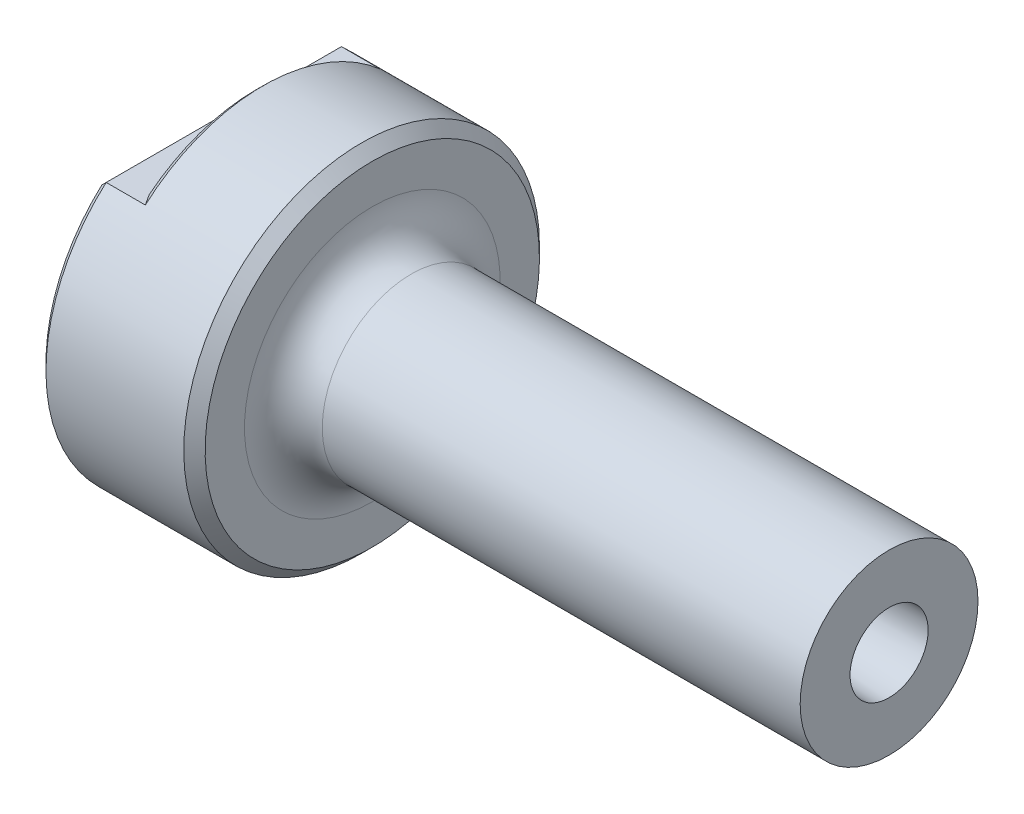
ISO-10303-21;
HEADER;
FILE_DESCRIPTION(('STEP AP214'),'2;1');
FILE_NAME('part.step','',(''),(''),'','','');
FILE_SCHEMA(('AUTOMOTIVE_DESIGN { 1 0 10303 214 1 1 1 1 }'));
ENDSEC;
DATA;
#1=APPLICATION_CONTEXT('core data for automotive mechanical design processes');
#2=APPLICATION_PROTOCOL_DEFINITION('international standard','automotive_design',2000,#1);
#3=PRODUCT_CONTEXT('',#1,'mechanical');
#4=PRODUCT('Part','Part','',(#3));
#5=PRODUCT_RELATED_PRODUCT_CATEGORY('part','',(#4));
#6=PRODUCT_DEFINITION_FORMATION('','',#4);
#7=PRODUCT_DEFINITION_CONTEXT('part definition',#1,'design');
#8=PRODUCT_DEFINITION('design','',#6,#7);
#9=PRODUCT_DEFINITION_SHAPE('','',#8);
#10=(LENGTH_UNIT() NAMED_UNIT(*) SI_UNIT(.MILLI.,.METRE.));
#11=(NAMED_UNIT(*) PLANE_ANGLE_UNIT() SI_UNIT($,.RADIAN.));
#12=(NAMED_UNIT(*) SI_UNIT($,.STERADIAN.) SOLID_ANGLE_UNIT());
#13=UNCERTAINTY_MEASURE_WITH_UNIT(LENGTH_MEASURE(1.E-05),#10,'distance_accuracy_value','');
#14=(GEOMETRIC_REPRESENTATION_CONTEXT(3) GLOBAL_UNCERTAINTY_ASSIGNED_CONTEXT((#13)) GLOBAL_UNIT_ASSIGNED_CONTEXT((#10,
#11,#12)) REPRESENTATION_CONTEXT('',''));
#15=CARTESIAN_POINT('',(0.,0.,0.));
#16=DIRECTION('',(0.,0.,1.));
#17=DIRECTION('',(1.,0.,0.));
#18=AXIS2_PLACEMENT_3D('',#15,#16,#17);
#19=CARTESIAN_POINT('',(48.021875,0.,0.));
#20=DIRECTION('',(1.,0.,0.));
#21=DIRECTION('',(0.,0.,-1.));
#22=AXIS2_PLACEMENT_3D('',#19,#20,#21);
#23=PLANE('',#22);
#24=CARTESIAN_POINT('',(48.021875,0.,0.));
#25=DIRECTION('',(1.,0.,0.));
#26=DIRECTION('',(0.,1.,0.));
#27=AXIS2_PLACEMENT_3D('',#24,#25,#26);
#28=CIRCLE('',#27,12.7);
#29=CARTESIAN_POINT('',(48.021875,12.7,0.));
#30=VERTEX_POINT('',#29);
#31=EDGE_CURVE('E102',#30,#30,#28,.T.);
#32=ORIENTED_EDGE('',*,*,#31,.T.);
#33=EDGE_LOOP('',(#32));
#34=FACE_BOUND('',#33,.T.);
#35=CARTESIAN_POINT('',(48.021875,0.,0.));
#36=DIRECTION('',(1.,0.,0.));
#37=DIRECTION('',(0.,1.,0.));
#38=AXIS2_PLACEMENT_3D('',#35,#36,#37);
#39=CIRCLE('',#38,5.57787310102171);
#40=CARTESIAN_POINT('',(48.021875,5.57787310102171,0.));
#41=VERTEX_POINT('',#40);
#42=EDGE_CURVE('E158',#41,#41,#39,.T.);
#43=ORIENTED_EDGE('',*,*,#42,.F.);
#44=EDGE_LOOP('',(#43));
#45=FACE_BOUND('',#44,.T.);
#46=ADVANCED_FACE('F33',(#34,#45),#23,.T.);
#47=CARTESIAN_POINT('',(-48.021875,0.,0.));
#48=DIRECTION('',(1.,0.,0.));
#49=DIRECTION('',(0.,0.,-1.));
#50=AXIS2_PLACEMENT_3D('',#47,#48,#49);
#51=PLANE('',#50);
#52=CARTESIAN_POINT('',(-48.021875,0.,0.));
#53=DIRECTION('',(1.,0.,0.));
#54=DIRECTION('',(0.,0.,-1.));
#55=AXIS2_PLACEMENT_3D('',#52,#53,#54);
#56=CIRCLE('',#55,24.384);
#57=CARTESIAN_POINT('',(-48.021875,18.034,-16.4120169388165));
#58=VERTEX_POINT('',#57);
#59=CARTESIAN_POINT('',(-48.021875,18.034,16.4120169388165));
#60=VERTEX_POINT('',#59);
#61=EDGE_CURVE('E53',#58,#60,#56,.F.);
#62=ORIENTED_EDGE('',*,*,#61,.T.);
#63=DIRECTION('',(0.,0.,-1.));
#64=VECTOR('',#63,1.);
#65=CARTESIAN_POINT('',(-48.021875,18.034,0.));
#66=LINE('',#65,#64);
#67=EDGE_CURVE('E127',#60,#58,#66,.T.);
#68=ORIENTED_EDGE('',*,*,#67,.T.);
#69=EDGE_LOOP('',(#62,#68));
#70=FACE_BOUND('',#69,.T.);
#71=CARTESIAN_POINT('',(-48.021875,0.,0.));
#72=DIRECTION('',(1.,0.,0.));
#73=DIRECTION('',(0.,1.,0.));
#74=AXIS2_PLACEMENT_3D('',#71,#72,#73);
#75=CIRCLE('',#74,9.80045101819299);
#76=CARTESIAN_POINT('',(-48.021875,9.80045101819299,0.));
#77=VERTEX_POINT('',#76);
#78=EDGE_CURVE('E107',#77,#77,#75,.T.);
#79=ORIENTED_EDGE('',*,*,#78,.T.);
#80=EDGE_LOOP('',(#79));
#81=FACE_BOUND('',#80,.T.);
#82=ADVANCED_FACE('F167',(#70,#81),#51,.F.);
#83=CARTESIAN_POINT('',(48.021875,0.,0.));
#84=DIRECTION('',(-1.,0.,0.));
#85=DIRECTION('',(0.,0.,1.));
#86=AXIS2_PLACEMENT_3D('',#83,#84,#85);
#87=CYLINDRICAL_SURFACE('',#86,25.4);
#88=CARTESIAN_POINT('',(-27.320875,0.,0.));
#89=DIRECTION('',(1.,0.,0.));
#90=DIRECTION('',(0.,0.,-1.));
#91=AXIS2_PLACEMENT_3D('',#88,#89,#90);
#92=CIRCLE('',#91,25.4);
#93=CARTESIAN_POINT('',(-27.320875,0.,-25.4));
#94=VERTEX_POINT('',#93);
#95=EDGE_CURVE('E98',#94,#94,#92,.F.);
#96=ORIENTED_EDGE('',*,*,#95,.T.);
#97=EDGE_LOOP('',(#96));
#98=FACE_BOUND('',#97,.T.);
#99=DIRECTION('',(-1.,0.,0.));
#100=VECTOR('',#99,1.);
#101=CARTESIAN_POINT('',(48.021875,19.05,-16.8005208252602));
#102=LINE('',#101,#100);
#103=CARTESIAN_POINT('',(-47.005875,19.05,-16.8005208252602));
#104=VERTEX_POINT('',#103);
#105=CARTESIAN_POINT('',(-41.417875,19.05,-16.8005208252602));
#106=VERTEX_POINT('',#105);
#107=EDGE_CURVE('E101',#104,#106,#102,.F.);
#108=ORIENTED_EDGE('',*,*,#107,.T.);
#109=CARTESIAN_POINT('',(-41.417875,0.,0.));
#110=DIRECTION('',(-1.,0.,0.));
#111=DIRECTION('',(0.,0.,1.));
#112=AXIS2_PLACEMENT_3D('',#109,#110,#111);
#113=CIRCLE('',#112,25.4);
#114=CARTESIAN_POINT('',(-41.417875,19.05,16.8005208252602));
#115=VERTEX_POINT('',#114);
#116=EDGE_CURVE('E87',#106,#115,#113,.F.);
#117=ORIENTED_EDGE('',*,*,#116,.T.);
#118=DIRECTION('',(-1.,0.,0.));
#119=VECTOR('',#118,1.);
#120=CARTESIAN_POINT('',(48.021875,19.05,16.8005208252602));
#121=LINE('',#120,#119);
#122=CARTESIAN_POINT('',(-47.005875,19.05,16.8005208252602));
#123=VERTEX_POINT('',#122);
#124=EDGE_CURVE('E104',#115,#123,#121,.T.);
#125=ORIENTED_EDGE('',*,*,#124,.T.);
#126=CARTESIAN_POINT('',(-47.005875,0.,0.));
#127=DIRECTION('',(1.,0.,0.));
#128=DIRECTION('',(0.,0.,-1.));
#129=AXIS2_PLACEMENT_3D('',#126,#127,#128);
#130=CIRCLE('',#129,25.4);
#131=EDGE_CURVE('E97',#123,#104,#130,.T.);
#132=ORIENTED_EDGE('',*,*,#131,.T.);
#133=EDGE_LOOP('',(#108,#117,#125,#132));
#134=FACE_BOUND('',#133,.T.);
#135=ADVANCED_FACE('F189',(#98,#134),#87,.T.);
#136=CARTESIAN_POINT('',(-42.433875,0.,0.));
#137=DIRECTION('',(-1.,0.,0.));
#138=DIRECTION('',(0.,0.,1.));
#139=AXIS2_PLACEMENT_3D('',#136,#137,#138);
#140=PLANE('',#139);
#141=DIRECTION('',(0.,0.,1.));
#142=VECTOR('',#141,1.);
#143=CARTESIAN_POINT('',(-42.433875,19.05,-25.4));
#144=LINE('',#143,#142);
#145=CARTESIAN_POINT('',(-42.433875,19.05,-15.2209380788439));
#146=VERTEX_POINT('',#145);
#147=CARTESIAN_POINT('',(-42.433875,19.05,15.2209380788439));
#148=VERTEX_POINT('',#147);
#149=EDGE_CURVE('E96',#146,#148,#144,.T.);
#150=ORIENTED_EDGE('',*,*,#149,.T.);
#151=CARTESIAN_POINT('',(-42.433875,0.,0.));
#152=DIRECTION('',(-1.,0.,0.));
#153=DIRECTION('',(0.,0.,1.));
#154=AXIS2_PLACEMENT_3D('',#151,#152,#153);
#155=CIRCLE('',#154,24.384);
#156=EDGE_CURVE('E85',#148,#146,#155,.T.);
#157=ORIENTED_EDGE('',*,*,#156,.T.);
#158=EDGE_LOOP('',(#150,#157));
#159=FACE_BOUND('',#158,.T.);
#160=ADVANCED_FACE('F95',(#159),#140,.T.);
#161=CARTESIAN_POINT('',(-42.433875,19.05,-25.4));
#162=DIRECTION('',(0.,-1.,0.));
#163=DIRECTION('',(0.,0.,-1.));
#164=AXIS2_PLACEMENT_3D('',#161,#162,#163);
#165=PLANE('',#164);
#166=ORIENTED_EDGE('',*,*,#107,.F.);
#167=DIRECTION('',(0.,0.,1.));
#168=VECTOR('',#167,1.);
#169=CARTESIAN_POINT('',(-47.005875,19.05,-25.4));
#170=LINE('',#169,#168);
#171=EDGE_CURVE('E91',#104,#123,#170,.T.);
#172=ORIENTED_EDGE('',*,*,#171,.T.);
#173=ORIENTED_EDGE('',*,*,#124,.F.);
#174=CARTESIAN_POINT('',(-41.417875,19.05,16.8005208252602));
#175=CARTESIAN_POINT('',(-41.5042219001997,19.05,16.6699759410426));
#176=CARTESIAN_POINT('',(-41.590175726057,19.05,16.5391707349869));
#177=CARTESIAN_POINT('',(-41.7612541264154,19.05,16.2770272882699));
#178=CARTESIAN_POINT('',(-41.8463787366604,19.05,16.1456890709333));
#179=CARTESIAN_POINT('',(-42.0157633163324,19.05,15.8824555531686));
#180=CARTESIAN_POINT('',(-42.1000232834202,19.05,15.7505602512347));
#181=CARTESIAN_POINT('',(-42.2676390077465,19.05,15.4861884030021));
#182=CARTESIAN_POINT('',(-42.3509947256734,19.05,15.3537118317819));
#183=CARTESIAN_POINT('',(-42.433875,19.05,15.2209380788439));
#184=B_SPLINE_CURVE_WITH_KNOTS('',3,(#174,#175,#176,#177,#178,#179,#180,#181,#182,#183),
.UNSPECIFIED.,.F.,.F.,(4,2,2,2,4),(0.,0.4695524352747,0.939084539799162,1.40861791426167,
1.87817162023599),.UNSPECIFIED.);
#185=EDGE_CURVE('E11',#115,#148,#184,.T.);
#186=ORIENTED_EDGE('',*,*,#185,.T.);
#187=ORIENTED_EDGE('',*,*,#149,.F.);
#188=CARTESIAN_POINT('',(-42.433875,19.05,-15.2209380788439));
#189=CARTESIAN_POINT('',(-42.3509947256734,19.05,-15.3537118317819));
#190=CARTESIAN_POINT('',(-42.2676390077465,19.05,-15.4861884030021));
#191=CARTESIAN_POINT('',(-42.1000232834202,19.05,-15.7505602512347));
#192=CARTESIAN_POINT('',(-42.0157633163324,19.05,-15.8824555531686));
#193=CARTESIAN_POINT('',(-41.8463787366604,19.05,-16.1456890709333));
#194=CARTESIAN_POINT('',(-41.7612541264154,19.05,-16.2770272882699));
#195=CARTESIAN_POINT('',(-41.590175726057,19.05,-16.5391707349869));
#196=CARTESIAN_POINT('',(-41.5042219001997,19.05,-16.6699759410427));
#197=CARTESIAN_POINT('',(-41.417875,19.05,-16.8005208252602));
#198=B_SPLINE_CURVE_WITH_KNOTS('',3,(#188,#189,#190,#191,#192,#193,#194,#195,#196,#197),
.UNSPECIFIED.,.F.,.F.,(4,2,2,2,4),(0.,0.469553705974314,0.939087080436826,1.40861918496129,
1.87817162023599),.UNSPECIFIED.);
#199=EDGE_CURVE('E46',#146,#106,#198,.T.);
#200=ORIENTED_EDGE('',*,*,#199,.T.);
#201=EDGE_LOOP('',(#166,#172,#173,#186,#187,#200));
#202=FACE_BOUND('',#201,.T.);
#203=ADVANCED_FACE('F100',(#202),#165,.F.);
#204=CARTESIAN_POINT('',(-25.796875,-25.4,0.));
#205=DIRECTION('',(1.,0.,0.));
#206=DIRECTION('',(0.,1.,0.));
#207=AXIS2_PLACEMENT_3D('',#204,#205,#206);
#208=PLANE('',#207);
#209=CARTESIAN_POINT('',(-25.796875,0.,0.));
#210=DIRECTION('',(1.,0.,0.));
#211=DIRECTION('',(0.,1.,0.));
#212=AXIS2_PLACEMENT_3D('',#209,#210,#211);
#213=CIRCLE('',#212,23.876);
#214=CARTESIAN_POINT('',(-25.796875,23.876,0.));
#215=VERTEX_POINT('',#214);
#216=EDGE_CURVE('E119',#215,#215,#213,.T.);
#217=ORIENTED_EDGE('',*,*,#216,.T.);
#218=EDGE_LOOP('',(#217));
#219=FACE_BOUND('',#218,.T.);
#220=CARTESIAN_POINT('',(-25.796875,0.,0.));
#221=DIRECTION('',(1.,0.,0.));
#222=DIRECTION('',(0.,1.,0.));
#223=AXIS2_PLACEMENT_3D('',#220,#221,#222);
#224=CIRCLE('',#223,18.25625);
#225=CARTESIAN_POINT('',(-25.796875,18.25625,0.));
#226=VERTEX_POINT('',#225);
#227=EDGE_CURVE('E116',#226,#226,#224,.F.);
#228=ORIENTED_EDGE('',*,*,#227,.T.);
#229=EDGE_LOOP('',(#228));
#230=FACE_BOUND('',#229,.T.);
#231=ADVANCED_FACE('F181',(#219,#230),#208,.T.);
#232=CARTESIAN_POINT('',(48.021875,0.,0.));
#233=DIRECTION('',(1.,0.,0.));
#234=DIRECTION('',(0.,1.,0.));
#235=AXIS2_PLACEMENT_3D('',#232,#233,#234);
#236=CYLINDRICAL_SURFACE('',#235,12.7);
#237=CARTESIAN_POINT('',(-20.240625,0.,0.));
#238=DIRECTION('',(1.,0.,0.));
#239=DIRECTION('',(0.,1.,0.));
#240=AXIS2_PLACEMENT_3D('',#237,#238,#239);
#241=CIRCLE('',#240,12.7);
#242=CARTESIAN_POINT('',(-20.240625,12.7,0.));
#243=VERTEX_POINT('',#242);
#244=EDGE_CURVE('E113',#243,#243,#241,.T.);
#245=ORIENTED_EDGE('',*,*,#244,.T.);
#246=EDGE_LOOP('',(#245));
#247=FACE_BOUND('',#246,.T.);
#248=ORIENTED_EDGE('',*,*,#31,.F.);
#249=EDGE_LOOP('',(#248));
#250=FACE_BOUND('',#249,.T.);
#251=ADVANCED_FACE('F172',(#247,#250),#236,.T.);
#252=CARTESIAN_POINT('',(-56.099075,0.,0.));
#253=DIRECTION('',(1.,0.,0.));
#254=DIRECTION('',(0.,1.,0.));
#255=AXIS2_PLACEMENT_3D('',#252,#253,#254);
#256=SPHERICAL_SURFACE('',#255,12.7);
#257=CARTESIAN_POINT('',(-43.9117164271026,0.,0.));
#258=DIRECTION('',(1.,0.,0.));
#259=DIRECTION('',(0.,1.,0.));
#260=AXIS2_PLACEMENT_3D('',#257,#258,#259);
#261=CIRCLE('',#260,3.571875);
#262=CARTESIAN_POINT('',(-43.9117164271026,3.57187500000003,0.));
#263=VERTEX_POINT('',#262);
#264=EDGE_CURVE('E155',#263,#263,#261,.T.);
#265=CARTESIAN_POINT('',(-43.9117164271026,3.57187500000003,0.));
#266=CARTESIAN_POINT('',(-43.9339064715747,3.64758850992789,0.));
#267=CARTESIAN_POINT('',(-43.9568022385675,3.72309518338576,0.));
#268=CARTESIAN_POINT('',(-44.0039968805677,3.87366875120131,0.));
#269=CARTESIAN_POINT('',(-44.028295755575,3.948735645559,0.));
#270=CARTESIAN_POINT('',(-44.0782882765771,4.09840354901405,0.));
#271=CARTESIAN_POINT('',(-44.1039819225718,4.1730045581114,0.));
#272=CARTESIAN_POINT('',(-44.156755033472,4.32171478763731,0.));
#273=CARTESIAN_POINT('',(-44.1838344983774,4.39582400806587,0.));
#274=CARTESIAN_POINT('',(-44.2393698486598,4.54352491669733,0.));
#275=CARTESIAN_POINT('',(-44.2678257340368,4.61711660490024,0.));
#276=CARTESIAN_POINT('',(-44.3261040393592,4.76375688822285,0.));
#277=CARTESIAN_POINT('',(-44.3559264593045,4.83680548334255,0.));
#278=CARTESIAN_POINT('',(-44.4169274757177,4.98233420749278,0.));
#279=CARTESIAN_POINT('',(-44.4481060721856,5.0548143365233,0.));
#280=CARTESIAN_POINT('',(-44.5118086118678,5.19918095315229,0.));
#281=CARTESIAN_POINT('',(-44.5443325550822,5.27106744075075,0.));
#282=CARTESIAN_POINT('',(-44.6107144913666,5.41422180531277,0.));
#283=CARTESIAN_POINT('',(-44.6445724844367,5.48548968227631,0.));
#284=CARTESIAN_POINT('',(-44.7136107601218,5.62738207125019,0.));
#285=CARTESIAN_POINT('',(-44.7487910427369,5.69800658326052,0.));
#286=CARTESIAN_POINT('',(-44.8204616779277,5.83858771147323,0.));
#287=CARTESIAN_POINT('',(-44.8569520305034,5.9085443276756,0.));
#288=CARTESIAN_POINT('',(-44.9312301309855,6.04776536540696,0.));
#289=CARTESIAN_POINT('',(-44.969017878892,6.11702978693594,0.));
#290=CARTESIAN_POINT('',(-45.0458776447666,6.25484237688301,0.));
#291=CARTESIAN_POINT('',(-45.0849496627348,6.3233905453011,0.));
#292=CARTESIAN_POINT('',(-45.1643643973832,6.4597468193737,0.));
#293=CARTESIAN_POINT('',(-45.2047071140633,6.52755492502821,0.));
#294=CARTESIAN_POINT('',(-45.2866492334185,6.66240752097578,0.));
#295=CARTESIAN_POINT('',(-45.3282486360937,6.72945201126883,0.));
#296=CARTESIAN_POINT('',(-45.4126896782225,6.86275408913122,0.));
#297=CARTESIAN_POINT('',(-45.4555313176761,6.92901167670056,0.));
#298=CARTESIAN_POINT('',(-45.5424419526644,7.06071693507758,0.));
#299=CARTESIAN_POINT('',(-45.586510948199,7.12616460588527,0.));
#300=CARTESIAN_POINT('',(-45.6758609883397,7.25622729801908,0.));
#301=CARTESIAN_POINT('',(-45.7211420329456,7.32084231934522,0.));
#302=CARTESIAN_POINT('',(-45.8129004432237,7.4492172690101,0.));
#303=CARTESIAN_POINT('',(-45.8593778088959,7.51297719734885,0.));
#304=CARTESIAN_POINT('',(-45.9535127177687,7.63961981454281,0.));
#305=CARTESIAN_POINT('',(-46.0011702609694,7.70250250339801,0.));
#306=CARTESIAN_POINT('',(-46.0976489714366,7.82736879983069,0.));
#307=CARTESIAN_POINT('',(-46.1464701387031,7.88935240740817,0.));
#308=CARTESIAN_POINT('',(-46.2452591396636,8.01239901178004,0.));
#309=CARTESIAN_POINT('',(-46.2952269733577,8.07346200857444,0.));
#310=CARTESIAN_POINT('',(-46.3962919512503,8.19464618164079,0.));
#311=CARTESIAN_POINT('',(-46.4473890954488,8.25476735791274,0.));
#312=CARTESIAN_POINT('',(-46.5506949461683,8.37404700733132,0.));
#313=CARTESIAN_POINT('',(-46.6029036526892,8.43320548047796,0.));
#314=CARTESIAN_POINT('',(-46.7084144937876,8.5505391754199,0.));
#315=CARTESIAN_POINT('',(-46.7617166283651,8.60871439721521,0.));
#316=CARTESIAN_POINT('',(-46.869395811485,8.72406138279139,0.));
#317=CARTESIAN_POINT('',(-46.9237728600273,8.78123314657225,0.));
#318=CARTESIAN_POINT('',(-47.0335829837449,8.89455335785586,0.));
#319=CARTESIAN_POINT('',(-47.0890160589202,8.9507018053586,0.));
#320=CARTESIAN_POINT('',(-47.200918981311,9.06195588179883,0.));
#321=CARTESIAN_POINT('',(-47.2573888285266,9.11706151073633,0.));
#322=CARTESIAN_POINT('',(-47.3713456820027,9.22621080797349,0.));
#323=CARTESIAN_POINT('',(-47.4288326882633,9.28025447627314,0.));
#324=CARTESIAN_POINT('',(-47.5448038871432,9.38726108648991,0.));
#325=CARTESIAN_POINT('',(-47.6032880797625,9.44022402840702,0.));
#326=CARTESIAN_POINT('',(-47.7212333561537,9.54505076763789,0.));
#327=CARTESIAN_POINT('',(-47.7806944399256,9.59691456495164,0.));
#328=CARTESIAN_POINT('',(-47.9005727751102,9.6995250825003,0.));
#329=CARTESIAN_POINT('',(-47.9609900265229,9.75027180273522,0.));
#330=CARTESIAN_POINT('',(-48.021875,9.80045101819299,0.));
#331=B_SPLINE_CURVE_WITH_KNOTS('',3,(#265,#266,#267,#268,#269,#270,#271,#272,#273,#274,#275,
#276,#277,#278,#279,#280,#281,#282,#283,#284,#285,#286,#287,#288,#289,#290,#291,#292,#293,#294,
#295,#296,#297,#298,#299,#300,#301,#302,#303,#304,#305,#306,#307,#308,#309,#310,#311,#312,#313,
#314,#315,#316,#317,#318,#319,#320,#321,#322,#323,#324,#325,#326,#327,#328,#329,#330),
.UNSPECIFIED.,.F.,.F.,(4,2,2,2,2,2,2,2,2,2,2,2,2,2,2,2,2,2,2,2,2,2,2,2,2,2,2,2,2,2,2,2,4),(0.,
0.236691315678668,0.473382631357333,0.710073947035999,0.946765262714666,1.18345657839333,
1.420147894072,1.65683920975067,1.89353052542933,2.130221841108,2.36691315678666,
2.60360447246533,2.840295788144,3.07698710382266,3.31367841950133,3.55036973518,
3.78706105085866,4.02375236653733,4.260443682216,4.49713499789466,4.73382631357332,
4.97051762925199,5.20720894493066,5.44390026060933,5.68059157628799,5.91728289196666,
6.15397420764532,6.39066552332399,6.62735683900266,6.86404815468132,7.10073947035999,
7.33743078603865,7.57412210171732),.UNSPECIFIED.);
#332=EDGE_CURVE('BSEAM169',#263,#77,#331,.T.);
#333=ORIENTED_EDGE('',*,*,#264,.T.);
#334=ORIENTED_EDGE('',*,*,#78,.F.);
#335=ORIENTED_EDGE('',*,*,#332,.T.);
#336=ORIENTED_EDGE('',*,*,#332,.F.);
#337=EDGE_LOOP('',(#333,#335,#334,#336));
#338=FACE_BOUND('',#337,.T.);
#339=ADVANCED_FACE('F169',(#338),#256,.F.);
#340=CARTESIAN_POINT('',(-43.9117164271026,0.,0.));
#341=DIRECTION('',(1.,0.,0.));
#342=DIRECTION('',(0.,1.,0.));
#343=AXIS2_PLACEMENT_3D('',#340,#341,#342);
#344=CONICAL_SURFACE('',#343,3.571875,0.0218166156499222);
#345=ORIENTED_EDGE('',*,*,#42,.T.);
#346=EDGE_LOOP('',(#345));
#347=FACE_BOUND('',#346,.T.);
#348=ORIENTED_EDGE('',*,*,#264,.F.);
#349=EDGE_LOOP('',(#348));
#350=FACE_BOUND('',#349,.T.);
#351=ADVANCED_FACE('F171',(#347,#350),#344,.F.);
#352=CARTESIAN_POINT('',(-20.240625,0.,0.));
#353=DIRECTION('',(1.,0.,0.));
#354=DIRECTION('',(0.,1.,0.));
#355=AXIS2_PLACEMENT_3D('',#352,#353,#354);
#356=TOROIDAL_SURFACE('',#355,18.25625,5.55625);
#357=ORIENTED_EDGE('',*,*,#227,.F.);
#358=EDGE_LOOP('',(#357));
#359=FACE_BOUND('',#358,.T.);
#360=ORIENTED_EDGE('',*,*,#244,.F.);
#361=EDGE_LOOP('',(#360));
#362=FACE_BOUND('',#361,.T.);
#363=ADVANCED_FACE('F178',(#359,#362),#356,.F.);
#364=CARTESIAN_POINT('',(-25.796875,0.,0.));
#365=DIRECTION('',(-1.,0.,0.));
#366=DIRECTION('',(0.,0.,1.));
#367=AXIS2_PLACEMENT_3D('',#364,#365,#366);
#368=CONICAL_SURFACE('',#367,23.876,0.785398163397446);
#369=ORIENTED_EDGE('',*,*,#95,.F.);
#370=EDGE_LOOP('',(#369));
#371=FACE_BOUND('',#370,.T.);
#372=ORIENTED_EDGE('',*,*,#216,.F.);
#373=EDGE_LOOP('',(#372));
#374=FACE_BOUND('',#373,.T.);
#375=ADVANCED_FACE('F145',(#371,#374),#368,.T.);
#376=CARTESIAN_POINT('',(-42.433875,0.,0.));
#377=DIRECTION('',(1.,0.,0.));
#378=DIRECTION('',(0.,0.,-1.));
#379=AXIS2_PLACEMENT_3D('',#376,#377,#378);
#380=CONICAL_SURFACE('',#379,24.384,0.785398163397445);
#381=ORIENTED_EDGE('',*,*,#185,.F.);
#382=ORIENTED_EDGE('',*,*,#116,.F.);
#383=ORIENTED_EDGE('',*,*,#199,.F.);
#384=ORIENTED_EDGE('',*,*,#156,.F.);
#385=EDGE_LOOP('',(#381,#382,#383,#384));
#386=FACE_BOUND('',#385,.T.);
#387=ADVANCED_FACE('F84',(#386),#380,.T.);
#388=CARTESIAN_POINT('',(-47.005875,0.,0.));
#389=DIRECTION('',(1.,0.,0.));
#390=DIRECTION('',(0.,0.,-1.));
#391=AXIS2_PLACEMENT_3D('',#388,#389,#390);
#392=CONICAL_SURFACE('',#391,25.4,0.78539816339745);
#393=CARTESIAN_POINT('',(-48.021875,18.034,-16.4120169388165));
#394=CARTESIAN_POINT('',(-47.852676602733,18.2031983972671,-16.4774733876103));
#395=CARTESIAN_POINT('',(-47.6834107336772,18.3724642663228,-16.5425769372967));
#396=CARTESIAN_POINT('',(-47.3447440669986,18.7111309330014,-16.6720782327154));
#397=CARTESIAN_POINT('',(-47.1753432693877,18.8805317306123,-16.7364759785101));
#398=CARTESIAN_POINT('',(-47.005875,19.05,-16.8005208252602));
#399=B_SPLINE_CURVE_WITH_KNOTS('',3,(#393,#394,#395,#396,#397,#398),.UNSPECIFIED.,.F.,.F.,(4,2,
4),(0.,0.74421977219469,1.48843947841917),.UNSPECIFIED.);
#400=EDGE_CURVE('E61',#104,#58,#399,.F.);
#401=ORIENTED_EDGE('',*,*,#400,.F.);
#402=ORIENTED_EDGE('',*,*,#131,.F.);
#403=CARTESIAN_POINT('',(-47.005875,19.05,16.8005208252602));
#404=CARTESIAN_POINT('',(-47.1753432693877,18.8805317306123,16.7364759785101));
#405=CARTESIAN_POINT('',(-47.3447440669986,18.7111309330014,16.6720782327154));
#406=CARTESIAN_POINT('',(-47.6834107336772,18.3724642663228,16.5425769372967));
#407=CARTESIAN_POINT('',(-47.852676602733,18.2031983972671,16.4774733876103));
#408=CARTESIAN_POINT('',(-48.021875,18.034,16.4120169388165));
#409=B_SPLINE_CURVE_WITH_KNOTS('',3,(#403,#404,#405,#406,#407,#408),.UNSPECIFIED.,.F.,.F.,(4,2,
4),(0.,0.744219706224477,1.48843947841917),.UNSPECIFIED.);
#410=EDGE_CURVE('E38',#60,#123,#409,.F.);
#411=ORIENTED_EDGE('',*,*,#410,.F.);
#412=ORIENTED_EDGE('',*,*,#61,.F.);
#413=EDGE_LOOP('',(#401,#402,#411,#412));
#414=FACE_BOUND('',#413,.T.);
#415=ADVANCED_FACE('F144',(#414),#392,.T.);
#416=CARTESIAN_POINT('',(-48.021875,18.034,0.));
#417=DIRECTION('',(0.707106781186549,-0.707106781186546,0.));
#418=DIRECTION('',(0.,0.,-1.));
#419=AXIS2_PLACEMENT_3D('',#416,#417,#418);
#420=PLANE('',#419);
#421=ORIENTED_EDGE('',*,*,#410,.T.);
#422=ORIENTED_EDGE('',*,*,#171,.F.);
#423=ORIENTED_EDGE('',*,*,#400,.T.);
#424=ORIENTED_EDGE('',*,*,#67,.F.);
#425=EDGE_LOOP('',(#421,#422,#423,#424));
#426=FACE_BOUND('',#425,.T.);
#427=ADVANCED_FACE('F35',(#426),#420,.F.);
#428=CLOSED_SHELL('',(#46,#82,#135,#160,#203,#231,#251,#339,#351,#363,#375,#387,#415,#427));
#429=MANIFOLD_SOLID_BREP('B2',#428);
#430=ADVANCED_BREP_SHAPE_REPRESENTATION('',(#18,#429),#14);
#431=SHAPE_DEFINITION_REPRESENTATION(#9,#430);
ENDSEC;
END-ISO-10303-21;
